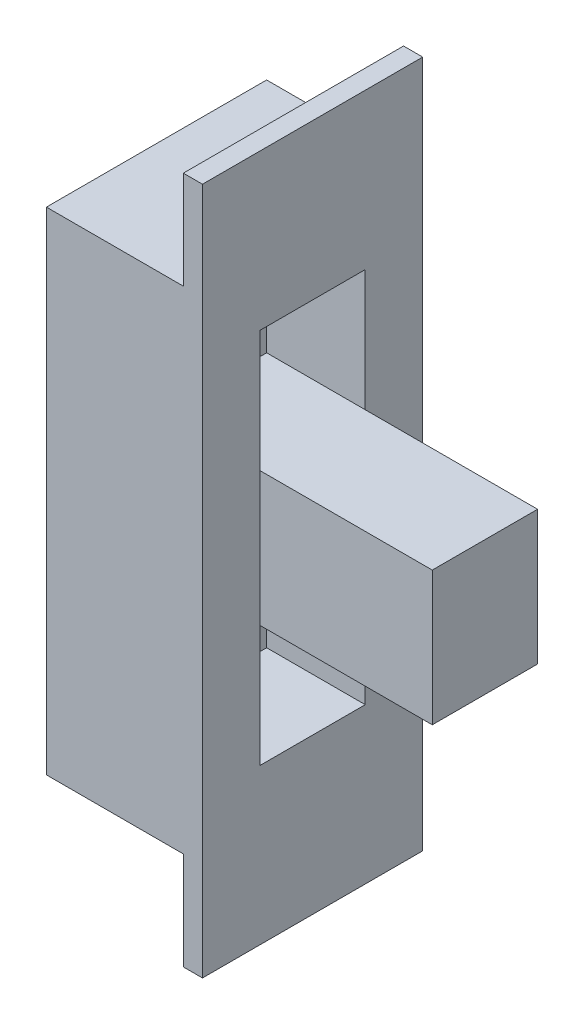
from build123d import *

# Parameters (mm, degrees)
SKETCH2_W           = 1
SKETCH2_H           = 35.9
BASE_EXTRUDE_DEPTH  = 11.5
SKETCH3_W           = 11.5
SKETCH3_H           = 25.678293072
BOSS_EXTRUDE1_DEPTH = 7.15
SKETCH4_W           = 5.5
SKETCH4_H           = 19.678293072
CUT_EXTRUDE1_DEPTH  = 5.15
SKETCH5_W           = 5.5
SKETCH5_H           = 7
BOSS_EXTRUDE3_DEPTH = 14.15


with BuildPart() as part:
    # Sketch2 → Base-Extrude (new body)
    with BuildSketch(Plane.XY):
        with Locations((-7.742570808, 38.78)):
            Rectangle(SKETCH2_W, SKETCH2_H)
    extrude(amount=BASE_EXTRUDE_DEPTH)

    # Sketch3 → Boss-Extrude1 (add)
    with BuildSketch(Plane.ZY.offset(8.242570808)):
        with Locations((5.75, 38.78)):
            Rectangle(SKETCH3_W, SKETCH3_H)
    extrude(amount=BOSS_EXTRUDE1_DEPTH)

    # Sketch4 → Cut-Extrude1 (cut)
    with BuildSketch(Plane(origin=(-7.242570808, 0, 0), x_dir=(0, 0, -1), z_dir=(1, 0, 0))):
        with Locations((-5.75, 38.78)):
            Rectangle(SKETCH4_W, SKETCH4_H)
    extrude(amount=-CUT_EXTRUDE1_DEPTH, mode=Mode.SUBTRACT)

    # Sketch5 → Boss-Extrude3 (add)
    with BuildSketch(Plane(origin=(-12.392570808, 0, 0), x_dir=(0, 0, -1), z_dir=(1, 0, 0))):
        with Locations((-5.75, 38.779386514)):
            Rectangle(SKETCH5_W, SKETCH5_H)
    extrude(amount=BOSS_EXTRUDE3_DEPTH)


solid = part.part
